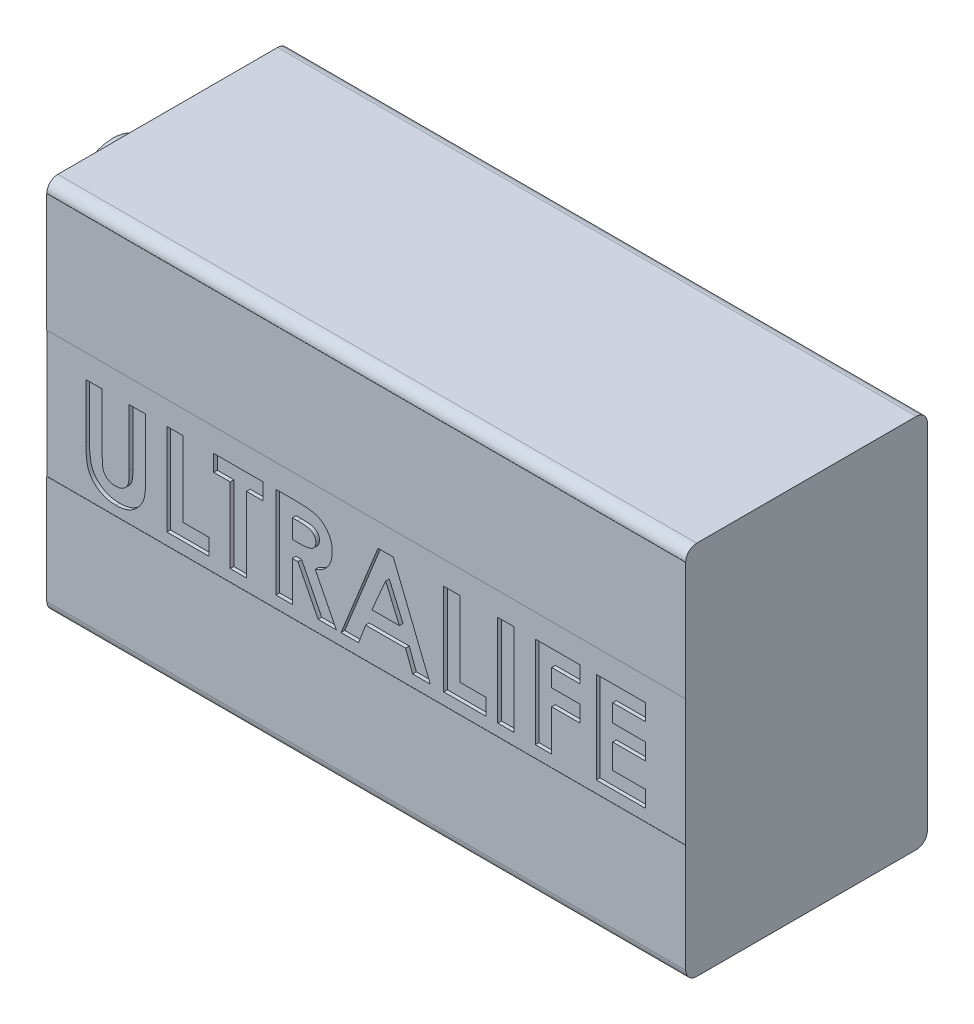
from build123d import *

# Parameters (mm, degrees)
SKETCH1_W          = 44.323
SKETCH1_H          = 26.035
EXTRUDE1_DEPTH     = 16.764
FILLET1_R          = 0.762
SKETCH2_W          = 1.139743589
SKETCH2_H          = 6.35
CUT_EXTRUDE1_DEPTH = 0.254
SKETCH4_W          = 44.323
SKETCH4_H          = 8.202960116
SKETCH4_H_2        = 7.513673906
EXTRUDE3_DEPTH     = 0.0127
SKETCH3_R          = 2.804319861
SKETCH3_R_2        = 2.38211514
SKETCH3_R_3        = 2.921
EXTRUDE4_DEPTH     = 3.81


with BuildPart() as part:
    # Sketch1 → Extrude1 (new body)
    with BuildSketch(Plane.XY):
        with Locations((6.872444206, 8.847757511)):
            Rectangle(SKETCH1_W, SKETCH1_H)
    extrude(amount=EXTRUDE1_DEPTH)

    # Fillet1
    fillet1_edges = [part.edges().sort_by_distance(p)[0] for p in [
        (6.872444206, 21.865257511, 16.764),
        (6.872444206, 21.865257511, 0),
        (6.872444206, -4.169742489, 0),
        (6.872444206, -4.169742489, 16.764),
    ]]
    fillet(fillet1_edges, radius=FILLET1_R)

    # Sketch2 → Cut-Extrude1 (cut)
    # profile 1 of 9: a face of its own
    with BuildSketch(Plane.XY.offset(16.764)):
        with BuildLine():
            Line((-12.584497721, 11.268884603), (-11.444754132, 11.268884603))
            Line((-11.444754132, 11.268884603), (-11.444754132, 7.13731409))
            add(Edge.make_bspline(
                [(-11.444754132, 7.13731409), (-11.444692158, 7.094479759), (-11.444572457, 7.011745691), (-11.43858014, 6.893049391), (-11.433096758, 6.783942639), (-11.423203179, 6.684544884), (-11.408586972, 6.594813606), (-11.394433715, 6.514172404), (-11.375278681, 6.444065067), (-11.346491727, 6.364264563), (-11.30214048, 6.274604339), (-11.229673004, 6.181158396), (-11.146051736, 6.095875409), (-11.045826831, 6.024889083), (-10.9331829, 5.967467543), (-10.808738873, 5.924924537), (-10.672670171, 5.901276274), (-10.578586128, 5.897665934), (-10.530160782, 5.89580768)],
                knots=[0, 0, 0, 0, 1.155499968, 2.231836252, 3.205919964, 4.102923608, 4.924856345, 5.658536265, 6.31071849, 6.882491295, 7.94666036, 8.992281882, 10.060072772, 11.158554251, 12.289267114, 13.461410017, 14.693379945, 16, 16, 16, 16], degree=3))
            add(Edge.make_bspline(
                [(-10.530160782, 5.89580768), (-10.478714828, 5.89730891), (-10.378403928, 5.900236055), (-10.234122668, 5.928969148), (-10.100445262, 5.974722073), (-9.980202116, 6.040023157), (-9.873512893, 6.11829795), (-9.783202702, 6.207555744), (-9.71193023, 6.307974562), (-9.665477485, 6.400618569), (-9.639396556, 6.48588931), (-9.619847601, 6.562075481), (-9.605516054, 6.651967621), (-9.592514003, 6.754161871), (-9.584700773, 6.869716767), (-9.576228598, 6.997703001), (-9.573123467, 7.138996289), (-9.57259422, 7.237381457), (-9.572318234, 7.288686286)],
                knots=[0, 0, 0, 0, 1.261321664, 2.459363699, 3.594844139, 4.716940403, 5.803436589, 6.833651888, 7.818396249, 8.814403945, 9.360733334, 10.004355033, 10.743453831, 11.592799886, 12.532235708, 13.585170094, 14.740740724, 16, 16, 16, 16], degree=3))
            Line((-9.572318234, 7.288686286), (-9.572318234, 11.268884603))
            Line((-9.572318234, 11.268884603), (-8.432574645, 11.268884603))
            Line((-8.432574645, 11.268884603), (-8.432574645, 7.48076361))
            add(Edge.make_bspline(
                [(-8.432574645, 7.48076361), (-8.432732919, 7.404016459), (-8.433037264, 7.256439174), (-8.437711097, 7.04436023), (-8.44766084, 6.850660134), (-8.456017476, 6.675282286), (-8.47219043, 6.518462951), (-8.489038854, 6.379532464), (-8.51051362, 6.258983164), (-8.542466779, 6.121752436), (-8.597608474, 5.963736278), (-8.686504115, 5.781787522), (-8.799351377, 5.603648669), (-8.932731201, 5.431279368), (-9.083329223, 5.271153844), (-9.247806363, 5.130584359), (-9.423549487, 5.011677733), (-9.612394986, 4.917341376), (-9.814182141, 4.84376613), (-10.030907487, 4.79432727), (-10.262423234, 4.760925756), (-10.422335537, 4.757717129), (-10.504720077, 4.75606409)],
                knots=[0, 0, 0, 0, 1.170808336, 2.251350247, 3.235597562, 4.129743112, 4.929140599, 5.639994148, 6.264258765, 6.79612947, 7.788252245, 8.809469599, 9.879094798, 10.999557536, 12.129761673, 13.226370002, 14.293821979, 15.358369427, 16.438775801, 17.562147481, 18.744053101, 20, 20, 20, 20], degree=3))
            add(Edge.make_bspline(
                [(-10.504720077, 4.75606409), (-10.559458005, 4.756986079), (-10.667454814, 4.758805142), (-10.826283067, 4.774844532), (-10.979821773, 4.798480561), (-11.127782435, 4.832963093), (-11.270678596, 4.877508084), (-11.408472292, 4.932339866), (-11.540651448, 4.997152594), (-11.666476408, 5.071350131), (-11.785792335, 5.151581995), (-11.894840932, 5.240522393), (-11.997374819, 5.331593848), (-12.090431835, 5.428629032), (-12.17471092, 5.530609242), (-12.250038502, 5.637765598), (-12.316302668, 5.750088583), (-12.375170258, 5.869602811), (-12.425555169, 6.002382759), (-12.468031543, 6.153151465), (-12.505139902, 6.324272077), (-12.532716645, 6.516130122), (-12.557717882, 6.728093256), (-12.573542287, 6.960713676), (-12.581820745, 7.213998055), (-12.583582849, 7.389594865), (-12.584497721, 7.48076361)],
                knots=[0, 0, 0, 0, 1.001158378, 1.975264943, 2.917723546, 3.841610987, 4.75185031, 5.653588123, 6.552117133, 7.442167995, 8.324307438, 9.179605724, 10.014504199, 10.831958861, 11.636465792, 12.43274043, 13.225645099, 14.020104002, 14.867201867, 15.819789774, 16.883317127, 18.068162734, 19.364263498, 20.787406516, 22.332041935, 24, 24, 24, 24], degree=3))
            Line((-12.584497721, 7.48076361), (-12.584497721, 11.268884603))
        make_face()
    # profile 2 of 9: a face of its own
    with BuildSketch(Plane.XY.offset(16.764)):
        Polygon((-6.967190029, 11.268884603), (-5.827446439, 11.268884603), (-5.827446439, 6.058628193), (-4.036420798, 6.058628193), (-4.036420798, 4.918884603), (-6.967190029, 4.918884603), align=None)
    # profile 3 of 9: a face of its own
    with BuildSketch(Plane.XY.offset(16.764)):
        Polygon((-3.710779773, 11.268884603), (-0.291549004, 11.268884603), (-0.291549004, 10.129141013), (-1.431292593, 10.129141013), (-1.431292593, 4.918884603), (-2.571036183, 4.918884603), (-2.571036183, 10.129141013), (-3.710779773, 10.129141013), align=None)
    # profile 4 of 9: a face of its own
    with BuildSketch(Plane.XY.offset(16.764)):
        with BuildLine():
            Line((0.603963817, 11.268884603), (1.931968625, 11.268884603))
            add(Edge.make_bspline(
                [(1.931968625, 11.268884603), (2.019749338, 11.268573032), (2.188576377, 11.267973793), (2.432015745, 11.258519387), (2.655648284, 11.245362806), (2.8598051, 11.225285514), (3.044398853, 11.198665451), (3.209614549, 11.167284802), (3.355447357, 11.131519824), (3.483127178, 11.08695384), (3.598351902, 11.036684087), (3.705757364, 10.978923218), (3.807713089, 10.914314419), (3.903537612, 10.841157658), (3.994063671, 10.760769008), (4.079462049, 10.673067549), (4.158525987, 10.577309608), (4.230765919, 10.474100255), (4.296606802, 10.365526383), (4.354796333, 10.251438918), (4.402116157, 10.131758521), (4.443928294, 10.008214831), (4.474044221, 9.879041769), (4.494989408, 9.745496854), (4.510324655, 9.607109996), (4.511206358, 9.513096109), (4.511656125, 9.46513861)],
                knots=[0, 0, 0, 0, 1.749336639, 3.364467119, 4.854658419, 6.213483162, 7.451590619, 8.570285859, 9.5643256, 10.440900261, 11.26203566, 12.067320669, 12.869050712, 13.665104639, 14.467235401, 15.27997916, 16.102287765, 16.939272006, 17.78853747, 18.631303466, 19.488103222, 20.351255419, 21.228522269, 22.127379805, 23.044756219, 24, 24, 24, 24], degree=3))
            add(Edge.make_bspline(
                [(4.511656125, 9.46513861), (4.510487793, 9.415081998), (4.508196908, 9.316930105), (4.495856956, 9.172752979), (4.4733034, 9.03481439), (4.439142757, 8.903518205), (4.399879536, 8.77723029), (4.347669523, 8.658280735), (4.288745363, 8.544939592), (4.21876286, 8.438810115), (4.141960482, 8.337534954), (4.052640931, 8.244994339), (3.956590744, 8.15621456), (3.848410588, 8.076756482), (3.732869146, 8.001247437), (3.607670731, 7.932816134), (3.473632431, 7.869742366), (3.379396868, 7.834568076), (3.331207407, 7.816580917)],
                knots=[0, 0, 0, 0, 1.099860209, 2.156625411, 3.176576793, 4.16617041, 5.135385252, 6.078461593, 7.016046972, 7.938469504, 8.868247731, 9.803980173, 10.76021508, 11.73834243, 12.748633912, 13.790971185, 14.870363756, 16, 16, 16, 16], degree=3))
            Line((3.331207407, 7.816580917), (4.796592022, 4.918884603))
            Line((4.796592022, 4.918884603), (3.529644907, 4.918884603))
            Line((3.529644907, 4.918884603), (2.130406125, 7.686833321))
            Line((2.130406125, 7.686833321), (1.743707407, 7.686833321))
            Line((1.743707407, 7.686833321), (1.743707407, 4.918884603))
            Line((1.743707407, 4.918884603), (0.603963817, 4.918884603))
            Line((0.603963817, 4.918884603), (0.603963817, 11.268884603))
        make_face()
        with BuildLine():
            Line((1.743707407, 8.826576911), (2.187647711, 8.826576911))
            add(Edge.make_bspline(
                [(2.187647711, 8.826576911), (2.241923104, 8.827188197), (2.345848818, 8.828358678), (2.495307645, 8.833787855), (2.631051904, 8.84686949), (2.753664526, 8.863397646), (2.863762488, 8.882481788), (2.960363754, 8.909830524), (3.044956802, 8.939135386), (3.116539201, 8.975553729), (3.177697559, 9.016969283), (3.230503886, 9.064018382), (3.27418229, 9.118471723), (3.310131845, 9.178849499), (3.33809669, 9.245685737), (3.358508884, 9.318246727), (3.369916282, 9.397359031), (3.371228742, 9.451957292), (3.371912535, 9.480403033)],
                knots=[0, 0, 0, 0, 1.688639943, 3.233382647, 4.650958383, 5.928841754, 7.082724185, 8.122798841, 9.049171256, 9.863274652, 10.613301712, 11.341792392, 12.054588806, 12.776240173, 13.521029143, 14.301969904, 15.115324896, 16, 16, 16, 16], degree=3))
            add(Edge.make_bspline(
                [(3.371912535, 9.480403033), (3.370619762, 9.51405642), (3.368080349, 9.580162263), (3.342881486, 9.675331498), (3.302770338, 9.763417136), (3.24778894, 9.844021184), (3.178547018, 9.914684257), (3.09908645, 9.976974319), (3.007692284, 10.026228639), (2.923068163, 10.058716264), (2.846079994, 10.078153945), (2.7766006, 10.092638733), (2.696143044, 10.102904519), (2.604646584, 10.113793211), (2.502344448, 10.120853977), (2.388679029, 10.126006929), (2.263976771, 10.128115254), (2.177047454, 10.128789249), (2.13167816, 10.129141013)],
                knots=[0, 0, 0, 0, 1.020303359, 2.004196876, 2.966617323, 3.9489082, 4.950758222, 5.960522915, 7.003732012, 8.091992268, 8.70421221, 9.413913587, 10.24622431, 11.166358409, 12.212345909, 13.359657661, 14.621978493, 16, 16, 16, 16], degree=3))
            Line((2.13167816, 10.129141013), (1.743707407, 10.129141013))
            Line((1.743707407, 10.129141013), (1.743707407, 8.826576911))
        make_face(mode=Mode.SUBTRACT)
    # profile 5 of 9: a face of its own
    with BuildSketch(Plane.XY.offset(16.764)):
        Polygon((7.68792816, 11.268884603), (8.744989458, 11.268884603), (11.309412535, 4.918884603), (10.092074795, 4.918884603), (9.598525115, 6.221448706), (6.831848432, 6.221448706), (6.338298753, 4.918884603), (5.122233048, 4.918884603), align=None)
        Polygon((8.215822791, 9.565629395), (7.26434042, 7.361192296), (9.167305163, 7.361192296), align=None, mode=Mode.SUBTRACT)
    # profile 6 of 9: a face of its own
    with BuildSketch(Plane.XY.offset(16.764)):
        Polygon((12.245630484, 11.268884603), (13.385374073, 11.268884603), (13.385374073, 6.058628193), (15.176399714, 6.058628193), (15.176399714, 4.918884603), (12.245630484, 4.918884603), align=None)
    # profile 7 of 9: a face of its own
    with BuildSketch(Plane.XY.offset(16.764)):
        with Locations((16.560374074, 8.093884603)):
            Rectangle(SKETCH2_W, SKETCH2_H)
    # profile 8 of 9: a face of its own
    with BuildSketch(Plane.XY.offset(16.764)):
        Polygon((18.595630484, 11.268884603), (21.689220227, 11.268884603), (21.689220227, 10.129141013), (19.735374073, 10.129141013), (19.735374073, 8.907987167), (21.689220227, 8.907987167), (21.689220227, 7.768243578), (19.735374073, 7.768243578), (19.735374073, 4.918884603), (18.595630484, 4.918884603), align=None)
    # profile 9 of 9: a face of its own
    with BuildSketch(Plane.XY.offset(16.764)):
        Polygon((22.828963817, 11.268884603), (26.248194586, 11.268884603), (26.248194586, 10.129141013), (23.968707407, 10.129141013), (23.968707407, 8.907987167), (26.248194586, 8.907987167), (26.248194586, 7.768243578), (23.968707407, 7.768243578), (23.968707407, 6.058628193), (26.248194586, 6.058628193), (26.248194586, 4.918884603), (22.828963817, 4.918884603), align=None)
    extrude(amount=-CUT_EXTRUDE1_DEPTH, mode=Mode.SUBTRACT)

    # Sketch4 → Extrude3 (add)
    with BuildSketch(Plane.XY.offset(16.764)):
        with Locations((6.872444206, 17.001777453)):
            Rectangle(SKETCH4_W, SKETCH4_H)
        with Locations((6.872444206, 0.349094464)):
            Rectangle(SKETCH4_W, SKETCH4_H_2)
    extrude(amount=EXTRUDE3_DEPTH)

    # Sketch3 → Extrude4 (add)
    # profile 1 of 2: a face of its own
    with BuildSketch(Plane.ZY.offset(15.289055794)):
        with Locations(Location((8.382, 15.515257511, 0), (0, 0, 90))):
            Circle(SKETCH3_R)
        with Locations(Location((8.382, 15.515257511, 0), (0, 0, 90))):
            Circle(SKETCH3_R_2, mode=Mode.SUBTRACT)
    # profile 2 of 2: a face of its own
    with BuildSketch(Plane.ZY.offset(15.289055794)):
        Polygon((4.048471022, 0.367547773), (8.340168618, -2.170462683), (12.683998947, 0.277251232), (12.736131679, 5.262975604), (8.444434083, 7.80098606), (4.100603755, 5.353272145), align=None)
        with Locations(Location((8.392301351, 2.815261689, 0), (0, 0, 90))):
            Circle(SKETCH3_R_3, mode=Mode.SUBTRACT)
    extrude(amount=EXTRUDE4_DEPTH)


solid = part.part
